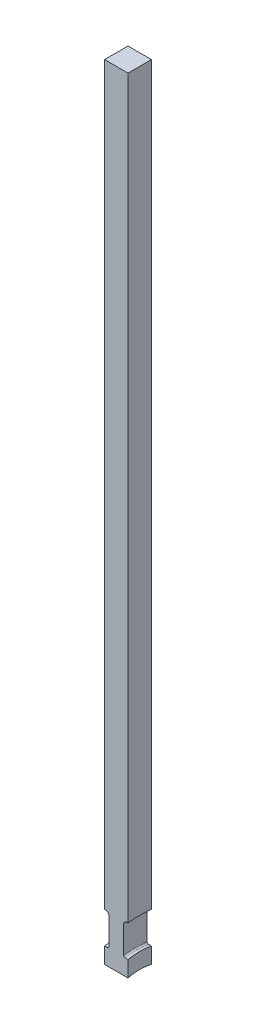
from build123d import *

# Parameters (mm, degrees)
SKETCH1_W               = 6
SKETCH1_H               = 212
BOSS_EXTRUDE1_DEPTH     = 3
CUT_EXTRUDE4_DEPTH      = 213.04244858
CUT_EXTRUDE4_DEPTH_BACK = 213.04244858
SKETCH8_R               = 12
SKETCH2_W               = 1.095
SKETCH2_H               = 8
FILLET1_R               = 0.762
FILLET2_R               = 0.381


with BuildPart() as part:
    # Sketch1 → Boss-Extrude1 (new, symmetric)
    with BuildSketch(Plane(origin=(0, 0, 0), x_dir=(0, 0, -1), z_dir=(1, 0, 0))):
        with Locations((0, 106)):
            Rectangle(SKETCH1_W, SKETCH1_H)
    extrude(amount=BOSS_EXTRUDE1_DEPTH, both=True)

    # Sketch8 → Cut-Extrude4 (cut, two sides: drawn at the far end of the back side and taken through both)
    with BuildSketch(Plane(origin=(0, 0, 0), x_dir=(0, 0, -1), z_dir=(1, 0, 0)).offset(-CUT_EXTRUDE4_DEPTH_BACK)):
        Circle(SKETCH8_R)
    extrude(amount=CUT_EXTRUDE4_DEPTH + CUT_EXTRUDE4_DEPTH_BACK, mode=Mode.SUBTRACT)

    # Sketch2 → Cut-Revolve1 (revolve, cut)
    with BuildSketch(Plane.XY):
        with Locations((2.4525, 20)):
            Rectangle(SKETCH2_W, SKETCH2_H)
        with Locations((-2.4525, 20)):
            Rectangle(SKETCH2_W, SKETCH2_H)
    revolve(axis=Axis((-8.84822894, 0, 0), (1, 0, 0)), mode=Mode.SUBTRACT)

    # Fillet1
    fillet1_edges = [part.edges().sort_by_distance(p)[0] for p in [
        (1.905, 24, 0),
        (-1.905, 24, 0),
    ]]
    fillet(fillet1_edges, radius=FILLET1_R)

    # Fillet2
    fillet2_edges = [part.edges().sort_by_distance(p)[0] for p in [
        (1.905, 16, 0),
        (-1.905, 16, 0),
    ]]
    fillet(fillet2_edges, radius=FILLET2_R)


solid = part.part
